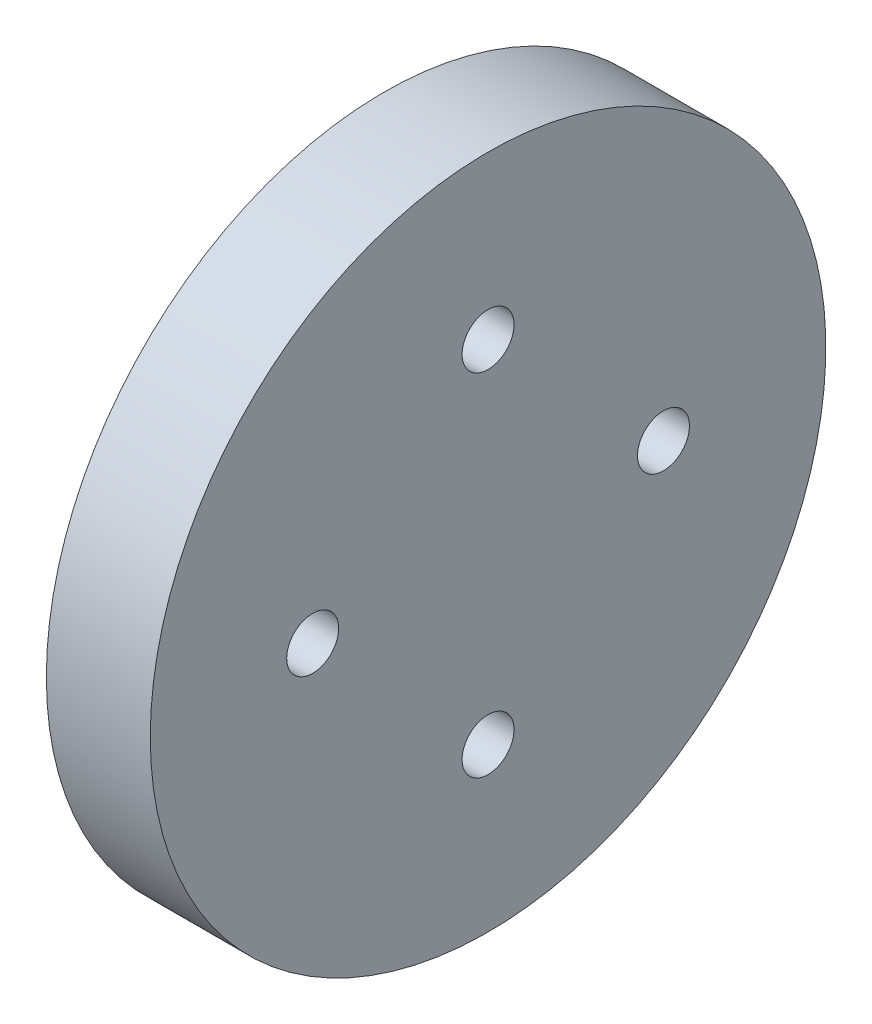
from build123d import *

# Parameters (mm, degrees)
CHANFREIN1_SIZE              = 1
ESQUISSE2_R                  = 1
ENL_V_MAT_EXTRU_1_DEPTH      = 19.814887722
R_P_TITION_CIRCULAIRE1_COUNT = 4


with BuildPart() as part:
    # Esquisse1 → Base-R_volution (revolve)
    with BuildSketch(Plane.XY, mode=Mode.PRIVATE) as base_r_volution_sk:
        Polygon((0, 0), (0, 4), (4, 4), (4, 13), (8, 13), (8, 0), align=None)
    revolve(base_r_volution_sk.sketch.rotate(Axis((0, 0, 0), (1, 0, 0)), 90), axis=Axis((0, 0, 0), (1, 0, 0)))

    # Chanfrein1
    chanfrein1_edges = [part.edges().sort_by_distance(p)[0] for p in [
        (0, 0, -4),
    ]]
    chamfer(chanfrein1_edges, length=CHANFREIN1_SIZE)

    # Esquisse2 → Enl_v. mat.-Extru.1 (cut, through all)
    with BuildSketch(Plane.ZY.offset(-4)):
        with Locations((0, 6.75)):
            Circle(ESQUISSE2_R)
    enl_v_mat_extru_1 = extrude(amount=-ENL_V_MAT_EXTRU_1_DEPTH, mode=Mode.SUBTRACT)

    # R_p_tition circulaire1: Enl_v. mat.-Extru.1 ×4 about axis
    r_p_tition_circulaire1_axis = Axis((0, 0, 0), (1, 0, 0))
    for i in range(1, R_P_TITION_CIRCULAIRE1_COUNT):
        add(enl_v_mat_extru_1.rotate(r_p_tition_circulaire1_axis, i * 360 / R_P_TITION_CIRCULAIRE1_COUNT), mode=Mode.SUBTRACT)


solid = part.part
